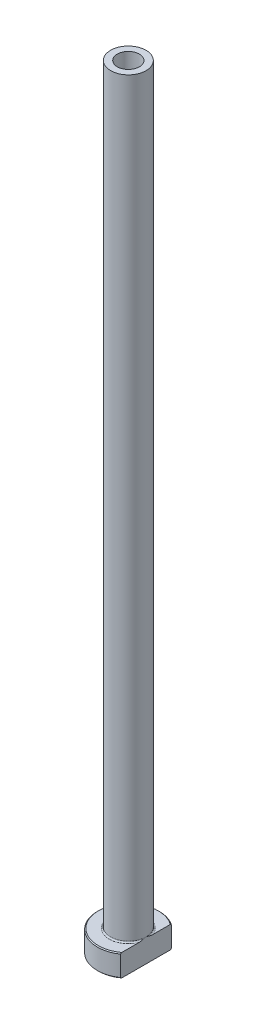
from build123d import *

# Parameters (mm, degrees)
FILLET1_R          = 0.3
CHAMFER1_SIZE      = 0.2
CUT_EXTRUDE1_DEPTH = 176.279776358
CHAMFER2_SIZE      = 0.5


with BuildPart() as part:
    # Sketch1 → Revolve1 (revolve)
    with BuildSketch(Plane.XY, mode=Mode.PRIVATE) as revolve1_sk:
        Polygon((-2.5, 175), (-4, 175), (-4, 5), (-7, 5), (-7, 0), (-2.75, 0), (-2.75, 118), (-2.5, 130), align=None)
    revolve(revolve1_sk.sketch.rotate(Axis((0, 92.187680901, 0), (0, -1, 0)), 270), axis=Axis((0, 92.187680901, 0), (0, -1, 0)))

    # Fillet1
    fillet1_edges = [part.edges().sort_by_distance(p)[0] for p in [
        (0, 5, -4),
    ]]
    fillet(fillet1_edges, radius=FILLET1_R)

    # Chamfer1
    chamfer1_edges = [part.edges().sort_by_distance(p)[0] for p in [
        (0, 0, -7),
        (0, 5, -7),
    ]]
    chamfer(chamfer1_edges, length=CHAMFER1_SIZE)

    # Sketch2 → Cut-Extrude1 (cut, through all)
    with BuildSketch(Plane.XZ):
        with BuildLine():
            Line((4, 5.744562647), (4, -5.744562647))
            ThreePointArc((4, -5.744562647), (7, 0), (4, 5.744562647))
        make_face()
    extrude(amount=-CUT_EXTRUDE1_DEPTH, mode=Mode.SUBTRACT)

    # Chamfer2
    chamfer2_edges = [part.edges().sort_by_distance(p)[0] for p in [
        (0, 0, -2.75),
    ]]
    chamfer(chamfer2_edges, length=CHAMFER2_SIZE)


solid = part.part
